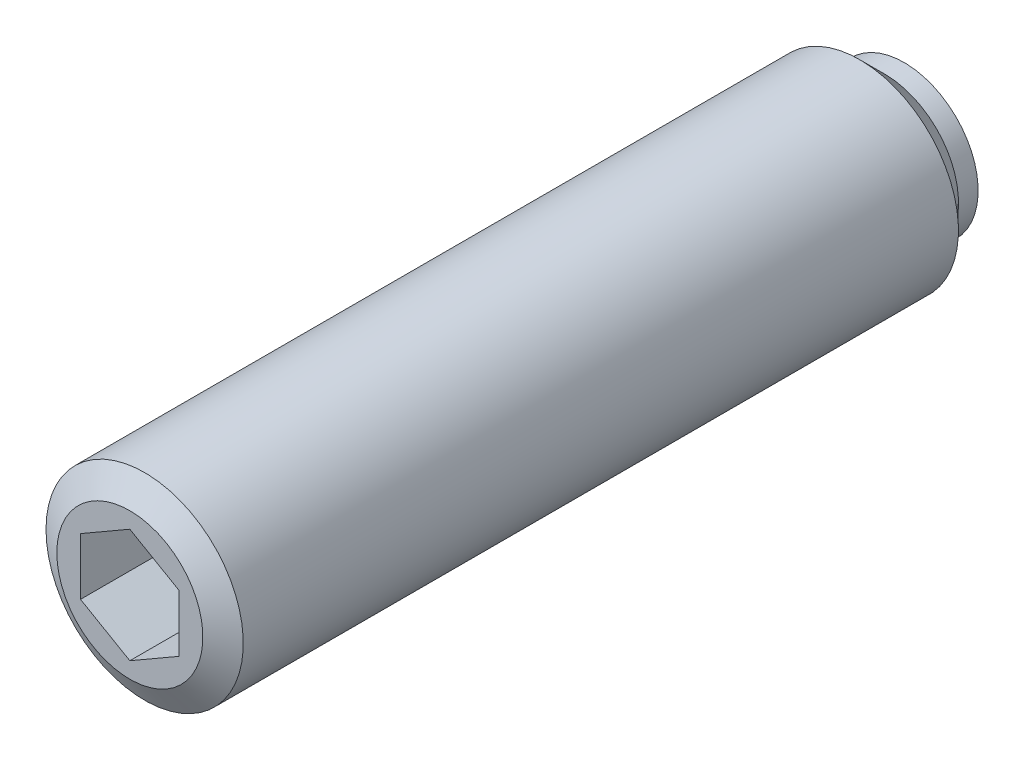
ISO-10303-21;
HEADER;
FILE_DESCRIPTION(('STEP AP214'),'2;1');
FILE_NAME('part.step','',(''),(''),'','','');
FILE_SCHEMA(('AUTOMOTIVE_DESIGN { 1 0 10303 214 1 1 1 1 }'));
ENDSEC;
DATA;
#1=APPLICATION_CONTEXT('core data for automotive mechanical design processes');
#2=APPLICATION_PROTOCOL_DEFINITION('international standard','automotive_design',2000,#1);
#3=PRODUCT_CONTEXT('',#1,'mechanical');
#4=PRODUCT('Part','Part','',(#3));
#5=PRODUCT_RELATED_PRODUCT_CATEGORY('part','',(#4));
#6=PRODUCT_DEFINITION_FORMATION('','',#4);
#7=PRODUCT_DEFINITION_CONTEXT('part definition',#1,'design');
#8=PRODUCT_DEFINITION('design','',#6,#7);
#9=PRODUCT_DEFINITION_SHAPE('','',#8);
#10=(LENGTH_UNIT() NAMED_UNIT(*) SI_UNIT(.MILLI.,.METRE.));
#11=(NAMED_UNIT(*) PLANE_ANGLE_UNIT() SI_UNIT($,.RADIAN.));
#12=(NAMED_UNIT(*) SI_UNIT($,.STERADIAN.) SOLID_ANGLE_UNIT());
#13=UNCERTAINTY_MEASURE_WITH_UNIT(LENGTH_MEASURE(1.E-05),#10,'distance_accuracy_value','');
#14=(GEOMETRIC_REPRESENTATION_CONTEXT(3) GLOBAL_UNCERTAINTY_ASSIGNED_CONTEXT((#13)) GLOBAL_UNIT_ASSIGNED_CONTEXT((#10,
#11,#12)) REPRESENTATION_CONTEXT('',''));
#15=CARTESIAN_POINT('',(0.,0.,0.));
#16=DIRECTION('',(0.,0.,1.));
#17=DIRECTION('',(1.,0.,0.));
#18=AXIS2_PLACEMENT_3D('',#15,#16,#17);
#19=CARTESIAN_POINT('',(0.,0.940733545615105,0.));
#20=DIRECTION('',(0.,0.,1.));
#21=DIRECTION('',(-1.,0.,0.));
#22=AXIS2_PLACEMENT_3D('',#19,#20,#21);
#23=PLANE('',#22);
#24=CARTESIAN_POINT('',(0.,0.,0.));
#25=DIRECTION('',(0.,0.,1.));
#26=DIRECTION('',(-1.,0.,0.));
#27=AXIS2_PLACEMENT_3D('',#24,#25,#26);
#28=CIRCLE('',#27,0.940733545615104);
#29=CARTESIAN_POINT('',(0.,0.940733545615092,0.));
#30=VERTEX_POINT('',#29);
#31=EDGE_CURVE('E9',#30,#30,#28,.T.);
#32=ORIENTED_EDGE('',*,*,#31,.F.);
#33=EDGE_LOOP('',(#32));
#34=FACE_BOUND('',#33,.T.);
#35=ADVANCED_FACE('F14',(#34),#23,.F.);
#36=CARTESIAN_POINT('',(0.,0.,0.823116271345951));
#37=DIRECTION('',(0.,0.,1.));
#38=DIRECTION('',(0.,1.,0.));
#39=AXIS2_PLACEMENT_3D('',#36,#37,#38);
#40=SPHERICAL_SURFACE('',#39,1.25);
#41=CARTESIAN_POINT('',(0.,0.,0.200000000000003));
#42=DIRECTION('',(0.,0.,1.));
#43=DIRECTION('',(-1.,0.,0.));
#44=AXIS2_PLACEMENT_3D('',#41,#42,#43);
#45=CIRCLE('',#44,1.08361714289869);
#46=CARTESIAN_POINT('',(0.,1.08361714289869,0.200000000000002));
#47=VERTEX_POINT('',#46);
#48=EDGE_CURVE('E21',#47,#47,#45,.T.);
#49=CARTESIAN_POINT('',(0.,1.08361714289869,0.200000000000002));
#50=CARTESIAN_POINT('',(0.,1.08233874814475,0.197776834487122));
#51=CARTESIAN_POINT('',(0.,1.08105351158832,0.195557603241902));
#52=CARTESIAN_POINT('',(0.,1.0784694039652,0.191127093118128));
#53=CARTESIAN_POINT('',(0.,1.0771705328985,0.188915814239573));
#54=CARTESIAN_POINT('',(0.,1.07455920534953,0.184501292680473));
#55=CARTESIAN_POINT('',(0.,1.07324674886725,0.182298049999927));
#56=CARTESIAN_POINT('',(0.,1.07060830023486,0.17789968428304));
#57=CARTESIAN_POINT('',(0.,1.06928230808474,0.175704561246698));
#58=CARTESIAN_POINT('',(0.,1.06661683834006,0.171322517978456));
#59=CARTESIAN_POINT('',(0.,1.0652773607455,0.169135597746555));
#60=CARTESIAN_POINT('',(0.,1.06258497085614,0.164770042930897));
#61=CARTESIAN_POINT('',(0.,1.06123205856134,0.16259140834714));
#62=CARTESIAN_POINT('',(0.,1.05851285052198,0.158242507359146));
#63=CARTESIAN_POINT('',(0.,1.05714655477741,0.156072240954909));
#64=CARTESIAN_POINT('',(0.,1.05440063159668,0.151740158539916));
#65=CARTESIAN_POINT('',(0.,1.05302100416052,0.14957834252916));
#66=CARTESIAN_POINT('',(0.,1.05024846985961,0.145263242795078));
#67=CARTESIAN_POINT('',(0.,1.04885556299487,0.143109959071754));
#68=CARTESIAN_POINT('',(0.,1.04605652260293,0.138812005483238));
#69=CARTESIAN_POINT('',(0.,1.04465038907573,0.136667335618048));
#70=CARTESIAN_POINT('',(0.,1.04182494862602,0.132386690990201));
#71=CARTESIAN_POINT('',(0.,1.04040564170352,0.130250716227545));
#72=CARTESIAN_POINT('',(0.,1.0375539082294,0.125987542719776));
#73=CARTESIAN_POINT('',(0.,1.03612148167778,0.123860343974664));
#74=CARTESIAN_POINT('',(0.,1.03324356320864,0.119614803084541));
#75=CARTESIAN_POINT('',(0.,1.03179807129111,0.117496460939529));
#76=CARTESIAN_POINT('',(0.,1.02889407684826,0.11326871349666));
#77=CARTESIAN_POINT('',(0.,1.02743557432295,0.111159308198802));
#78=CARTESIAN_POINT('',(0.,1.02450561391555,0.106949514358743));
#79=CARTESIAN_POINT('',(0.,1.02303415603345,0.104849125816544));
#80=CARTESIAN_POINT('',(0.,1.02007834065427,0.100657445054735));
#81=CARTESIAN_POINT('',(0.,1.01859398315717,0.0985661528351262));
#82=CARTESIAN_POINT('',(0.,1.01561242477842,0.094392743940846));
#83=CARTESIAN_POINT('',(0.,1.01411522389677,0.0923106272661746));
#84=CARTESIAN_POINT('',(0.,1.01110803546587,0.0881556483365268));
#85=CARTESIAN_POINT('',(0.,1.00959804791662,0.0860827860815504));
#86=CARTESIAN_POINT('',(0.,1.00656534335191,0.0819463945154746));
#87=CARTESIAN_POINT('',(0.,1.00504262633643,0.0798828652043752));
#88=CARTESIAN_POINT('',(0.,1.00198452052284,0.0757652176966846));
#89=CARTESIAN_POINT('',(0.,1.00044913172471,0.0737110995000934));
#90=CARTESIAN_POINT('',(0.,0.997365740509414,0.0696123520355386));
#91=CARTESIAN_POINT('',(0.,0.995817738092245,0.067567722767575));
#92=CARTESIAN_POINT('',(0.,0.992709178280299,0.063488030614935));
#93=CARTESIAN_POINT('',(0.,0.991148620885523,0.0614529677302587));
#94=CARTESIAN_POINT('',(0.,0.988015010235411,0.0573924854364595));
#95=CARTESIAN_POINT('',(0.,0.986441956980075,0.0553670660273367));
#96=CARTESIAN_POINT('',(0.,0.983283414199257,0.0513259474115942));
#97=CARTESIAN_POINT('',(0.,0.981697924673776,0.0493102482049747));
#98=CARTESIAN_POINT('',(0.,0.978514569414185,0.0452886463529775));
#99=CARTESIAN_POINT('',(0.,0.976916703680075,0.0432827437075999));
#100=CARTESIAN_POINT('',(0.,0.973708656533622,0.0392808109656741));
#101=CARTESIAN_POINT('',(0.,0.972098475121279,0.0372847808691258));
#102=CARTESIAN_POINT('',(0.,0.968865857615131,0.0333026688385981));
#103=CARTESIAN_POINT('',(0.,0.967243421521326,0.0313165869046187));
#104=CARTESIAN_POINT('',(0.,0.963986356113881,0.0273544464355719));
#105=CARTESIAN_POINT('',(0.,0.962351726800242,0.0253783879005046));
#106=CARTESIAN_POINT('',(0.,0.959070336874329,0.0214363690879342));
#107=CARTESIAN_POINT('',(0.,0.957423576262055,0.0194704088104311));
#108=CARTESIAN_POINT('',(0.,0.954117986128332,0.0155486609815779));
#109=CARTESIAN_POINT('',(0.,0.952459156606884,0.0135928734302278));
#110=CARTESIAN_POINT('',(0.,0.949129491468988,0.00969154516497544));
#111=CARTESIAN_POINT('',(0.,0.947458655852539,0.00774600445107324));
#112=CARTESIAN_POINT('',(0.,0.944105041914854,0.00386524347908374));
#113=CARTESIAN_POINT('',(0.,0.942422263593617,0.00193002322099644));
#114=CARTESIAN_POINT('',(0.,0.940733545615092,0.));
#115=B_SPLINE_CURVE_WITH_KNOTS('',3,(#49,#50,#51,#52,#53,#54,#55,#56,#57,#58,#59,#60,#61,#62,
#63,#64,#65,#66,#67,#68,#69,#70,#71,#72,#73,#74,#75,#76,#77,#78,#79,#80,#81,#82,#83,#84,#85,#86,
#87,#88,#89,#90,#91,#92,#93,#94,#95,#96,#97,#98,#99,#100,#101,#102,#103,#104,#105,#106,#107,
#108,#109,#110,#111,#112,#113,#114),.UNSPECIFIED.,.F.,.F.,(4,2,2,2,2,2,2,2,2,2,2,2,2,2,2,2,2,2,
2,2,2,2,2,2,2,2,2,2,2,2,2,2,4),(0.,0.00769354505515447,0.0153870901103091,0.0230806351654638,
0.0307741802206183,0.0384677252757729,0.0461612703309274,0.0538548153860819,0.0615483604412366,
0.0692419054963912,0.0769354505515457,0.0846289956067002,0.0923225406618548,0.100016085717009,
0.107709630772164,0.115403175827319,0.123096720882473,0.130790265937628,0.138483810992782,
0.146177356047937,0.153870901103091,0.161564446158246,0.169257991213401,0.176951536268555,
0.18464508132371,0.192338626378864,0.200032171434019,0.207725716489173,0.215419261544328,
0.223112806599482,0.230806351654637,0.238499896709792,0.246193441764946),.UNSPECIFIED.);
#116=EDGE_CURVE('BSEAM141',#47,#30,#115,.T.);
#117=ORIENTED_EDGE('',*,*,#48,.F.);
#118=ORIENTED_EDGE('',*,*,#31,.T.);
#119=ORIENTED_EDGE('',*,*,#116,.T.);
#120=ORIENTED_EDGE('',*,*,#116,.F.);
#121=EDGE_LOOP('',(#117,#119,#118,#120));
#122=FACE_BOUND('',#121,.T.);
#123=ADVANCED_FACE('F141',(#122),#40,.T.);
#124=CARTESIAN_POINT('',(0.,1.5,0.200000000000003));
#125=DIRECTION('',(0.,0.,1.));
#126=DIRECTION('',(-1.,0.,0.));
#127=AXIS2_PLACEMENT_3D('',#124,#125,#126);
#128=PLANE('',#127);
#129=CARTESIAN_POINT('',(0.,0.,0.200000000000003));
#130=DIRECTION('',(0.,0.,1.));
#131=DIRECTION('',(-1.,0.,0.));
#132=AXIS2_PLACEMENT_3D('',#129,#130,#131);
#133=CIRCLE('',#132,1.5);
#134=CARTESIAN_POINT('',(-1.5,0.,0.200000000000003));
#135=VERTEX_POINT('',#134);
#136=EDGE_CURVE('E134',#135,#135,#133,.T.);
#137=ORIENTED_EDGE('',*,*,#136,.F.);
#138=EDGE_LOOP('',(#137));
#139=FACE_BOUND('',#138,.T.);
#140=ORIENTED_EDGE('',*,*,#48,.T.);
#141=EDGE_LOOP('',(#140));
#142=FACE_BOUND('',#141,.T.);
#143=ADVANCED_FACE('F139',(#139,#142),#128,.F.);
#144=CARTESIAN_POINT('',(0.,0.,17.2950749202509));
#145=DIRECTION('',(0.,0.,1.));
#146=DIRECTION('',(-1.,0.,0.));
#147=AXIS2_PLACEMENT_3D('',#144,#145,#146);
#148=CYLINDRICAL_SURFACE('',#147,1.5);
#149=CARTESIAN_POINT('',(0.,0.,0.6));
#150=DIRECTION('',(0.,0.,1.));
#151=DIRECTION('',(-1.,0.,0.));
#152=AXIS2_PLACEMENT_3D('',#149,#150,#151);
#153=CIRCLE('',#152,1.5);
#154=CARTESIAN_POINT('',(-1.5,0.,0.6));
#155=VERTEX_POINT('',#154);
#156=EDGE_CURVE('E131',#155,#155,#153,.T.);
#157=ORIENTED_EDGE('',*,*,#156,.F.);
#158=EDGE_LOOP('',(#157));
#159=FACE_BOUND('',#158,.T.);
#160=ORIENTED_EDGE('',*,*,#136,.T.);
#161=EDGE_LOOP('',(#160));
#162=FACE_BOUND('',#161,.T.);
#163=ADVANCED_FACE('F164',(#159,#162),#148,.T.);
#164=CARTESIAN_POINT('',(0.,0.,0.6));
#165=DIRECTION('',(0.,0.,1.));
#166=DIRECTION('',(-1.,0.,0.));
#167=AXIS2_PLACEMENT_3D('',#164,#165,#166);
#168=CONICAL_SURFACE('',#167,1.5,0.78539816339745);
#169=CARTESIAN_POINT('',(0.,0.,1.1));
#170=DIRECTION('',(0.,0.,1.));
#171=DIRECTION('',(-1.,0.,0.));
#172=AXIS2_PLACEMENT_3D('',#169,#170,#171);
#173=CIRCLE('',#172,2.);
#174=CARTESIAN_POINT('',(-2.,0.,1.1));
#175=VERTEX_POINT('',#174);
#176=EDGE_CURVE('E128',#175,#175,#173,.T.);
#177=ORIENTED_EDGE('',*,*,#176,.F.);
#178=EDGE_LOOP('',(#177));
#179=FACE_BOUND('',#178,.T.);
#180=ORIENTED_EDGE('',*,*,#156,.T.);
#181=EDGE_LOOP('',(#180));
#182=FACE_BOUND('',#181,.T.);
#183=ADVANCED_FACE('F173',(#179,#182),#168,.T.);
#184=CARTESIAN_POINT('',(0.,0.,17.2950749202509));
#185=DIRECTION('',(0.,0.,1.));
#186=DIRECTION('',(-1.,0.,0.));
#187=AXIS2_PLACEMENT_3D('',#184,#185,#186);
#188=CYLINDRICAL_SURFACE('',#187,2.);
#189=CARTESIAN_POINT('',(0.,0.,15.6));
#190=DIRECTION('',(0.,0.,1.));
#191=DIRECTION('',(-1.,0.,0.));
#192=AXIS2_PLACEMENT_3D('',#189,#190,#191);
#193=CIRCLE('',#192,2.);
#194=CARTESIAN_POINT('',(-2.,0.,15.6));
#195=VERTEX_POINT('',#194);
#196=EDGE_CURVE('E125',#195,#195,#193,.T.);
#197=ORIENTED_EDGE('',*,*,#196,.F.);
#198=EDGE_LOOP('',(#197));
#199=FACE_BOUND('',#198,.T.);
#200=ORIENTED_EDGE('',*,*,#176,.T.);
#201=EDGE_LOOP('',(#200));
#202=FACE_BOUND('',#201,.T.);
#203=ADVANCED_FACE('F182',(#199,#202),#188,.T.);
#204=CARTESIAN_POINT('',(0.,0.,15.6));
#205=DIRECTION('',(0.,0.,-1.));
#206=DIRECTION('',(1.,0.,0.));
#207=AXIS2_PLACEMENT_3D('',#204,#205,#206);
#208=CONICAL_SURFACE('',#207,2.,1.04719755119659);
#209=CARTESIAN_POINT('',(0.,0.,15.9));
#210=DIRECTION('',(0.,0.,1.));
#211=DIRECTION('',(-1.,0.,0.));
#212=AXIS2_PLACEMENT_3D('',#209,#210,#211);
#213=CIRCLE('',#212,1.48038475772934);
#214=CARTESIAN_POINT('',(-1.48038475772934,0.,15.9));
#215=VERTEX_POINT('',#214);
#216=EDGE_CURVE('E116',#215,#215,#213,.T.);
#217=ORIENTED_EDGE('',*,*,#216,.F.);
#218=EDGE_LOOP('',(#217));
#219=FACE_BOUND('',#218,.T.);
#220=ORIENTED_EDGE('',*,*,#196,.T.);
#221=EDGE_LOOP('',(#220));
#222=FACE_BOUND('',#221,.T.);
#223=ADVANCED_FACE('F191',(#219,#222),#208,.T.);
#224=CARTESIAN_POINT('',(0.,0.,15.9));
#225=DIRECTION('',(0.,0.,-1.));
#226=DIRECTION('',(1.,0.,0.));
#227=AXIS2_PLACEMENT_3D('',#224,#225,#226);
#228=PLANE('',#227);
#229=DIRECTION('',(-0.866025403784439,-0.5,0.));
#230=VECTOR('',#229,1.);
#231=CARTESIAN_POINT('',(0.,1.15470053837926,15.9));
#232=LINE('',#231,#230);
#233=CARTESIAN_POINT('',(0.,1.15470053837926,15.9));
#234=VERTEX_POINT('',#233);
#235=CARTESIAN_POINT('',(-1.,0.577350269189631,15.9));
#236=VERTEX_POINT('',#235);
#237=EDGE_CURVE('E82',#234,#236,#232,.T.);
#238=ORIENTED_EDGE('',*,*,#237,.F.);
#239=DIRECTION('',(-0.866025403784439,0.5,0.));
#240=VECTOR('',#239,1.);
#241=CARTESIAN_POINT('',(1.,0.577350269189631,15.9));
#242=LINE('',#241,#240);
#243=CARTESIAN_POINT('',(1.,0.577350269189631,15.9));
#244=VERTEX_POINT('',#243);
#245=EDGE_CURVE('E28',#244,#234,#242,.T.);
#246=ORIENTED_EDGE('',*,*,#245,.F.);
#247=DIRECTION('',(0.,1.,0.));
#248=VECTOR('',#247,1.);
#249=CARTESIAN_POINT('',(1.,-0.577350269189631,15.9));
#250=LINE('',#249,#248);
#251=CARTESIAN_POINT('',(1.,-0.577350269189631,15.9));
#252=VERTEX_POINT('',#251);
#253=EDGE_CURVE('E98',#252,#244,#250,.T.);
#254=ORIENTED_EDGE('',*,*,#253,.F.);
#255=DIRECTION('',(0.866025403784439,0.5,0.));
#256=VECTOR('',#255,1.);
#257=CARTESIAN_POINT('',(0.,-1.15470053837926,15.9));
#258=LINE('',#257,#256);
#259=CARTESIAN_POINT('',(0.,-1.15470053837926,15.9));
#260=VERTEX_POINT('',#259);
#261=EDGE_CURVE('E92',#260,#252,#258,.T.);
#262=ORIENTED_EDGE('',*,*,#261,.F.);
#263=DIRECTION('',(0.866025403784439,-0.5,0.));
#264=VECTOR('',#263,1.);
#265=CARTESIAN_POINT('',(-1.,-0.577350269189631,15.9));
#266=LINE('',#265,#264);
#267=CARTESIAN_POINT('',(-1.,-0.577350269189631,15.9));
#268=VERTEX_POINT('',#267);
#269=EDGE_CURVE('E90',#268,#260,#266,.T.);
#270=ORIENTED_EDGE('',*,*,#269,.F.);
#271=DIRECTION('',(0.,-1.,0.));
#272=VECTOR('',#271,1.);
#273=CARTESIAN_POINT('',(-1.,0.577350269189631,15.9));
#274=LINE('',#273,#272);
#275=EDGE_CURVE('E71',#236,#268,#274,.T.);
#276=ORIENTED_EDGE('',*,*,#275,.F.);
#277=EDGE_LOOP('',(#238,#246,#254,#262,#270,#276));
#278=FACE_BOUND('',#277,.T.);
#279=ORIENTED_EDGE('',*,*,#216,.T.);
#280=EDGE_LOOP('',(#279));
#281=FACE_BOUND('',#280,.T.);
#282=ADVANCED_FACE('F86',(#278,#281),#228,.F.);
#283=CARTESIAN_POINT('',(1.,0.577350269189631,13.9));
#284=DIRECTION('',(0.5,0.866025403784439,0.));
#285=DIRECTION('',(0.866025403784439,-0.5,0.));
#286=AXIS2_PLACEMENT_3D('',#283,#284,#285);
#287=PLANE('',#286);
#288=ORIENTED_EDGE('',*,*,#245,.T.);
#289=DIRECTION('',(0.,0.,1.));
#290=VECTOR('',#289,1.);
#291=CARTESIAN_POINT('',(0.,1.15470053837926,13.9));
#292=LINE('',#291,#290);
#293=CARTESIAN_POINT('',(0.,1.15470053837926,13.9));
#294=VERTEX_POINT('',#293);
#295=EDGE_CURVE('E79',#294,#234,#292,.T.);
#296=ORIENTED_EDGE('',*,*,#295,.F.);
#297=DIRECTION('',(-0.866025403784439,0.5,0.));
#298=VECTOR('',#297,1.);
#299=CARTESIAN_POINT('',(1.,0.577350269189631,13.9));
#300=LINE('',#299,#298);
#301=CARTESIAN_POINT('',(1.,0.577350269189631,13.9));
#302=VERTEX_POINT('',#301);
#303=EDGE_CURVE('E100',#302,#294,#300,.T.);
#304=ORIENTED_EDGE('',*,*,#303,.F.);
#305=DIRECTION('',(0.,0.,1.));
#306=VECTOR('',#305,1.);
#307=CARTESIAN_POINT('',(1.,0.577350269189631,13.9));
#308=LINE('',#307,#306);
#309=EDGE_CURVE('E35',#302,#244,#308,.T.);
#310=ORIENTED_EDGE('',*,*,#309,.T.);
#311=EDGE_LOOP('',(#288,#296,#304,#310));
#312=FACE_BOUND('',#311,.T.);
#313=ADVANCED_FACE('F208',(#312),#287,.F.);
#314=CARTESIAN_POINT('',(1.,-0.577350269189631,13.9));
#315=DIRECTION('',(1.,0.,0.));
#316=DIRECTION('',(0.,-1.,0.));
#317=AXIS2_PLACEMENT_3D('',#314,#315,#316);
#318=PLANE('',#317);
#319=ORIENTED_EDGE('',*,*,#253,.T.);
#320=ORIENTED_EDGE('',*,*,#309,.F.);
#321=DIRECTION('',(0.,1.,0.));
#322=VECTOR('',#321,1.);
#323=CARTESIAN_POINT('',(1.,-0.577350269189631,13.9));
#324=LINE('',#323,#322);
#325=CARTESIAN_POINT('',(1.,-0.577350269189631,13.9));
#326=VERTEX_POINT('',#325);
#327=EDGE_CURVE('E112',#326,#302,#324,.T.);
#328=ORIENTED_EDGE('',*,*,#327,.F.);
#329=DIRECTION('',(0.,0.,1.));
#330=VECTOR('',#329,1.);
#331=CARTESIAN_POINT('',(1.,-0.577350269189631,13.9));
#332=LINE('',#331,#330);
#333=EDGE_CURVE('E117',#326,#252,#332,.T.);
#334=ORIENTED_EDGE('',*,*,#333,.T.);
#335=EDGE_LOOP('',(#319,#320,#328,#334));
#336=FACE_BOUND('',#335,.T.);
#337=ADVANCED_FACE('F216',(#336),#318,.F.);
#338=CARTESIAN_POINT('',(0.,-1.15470053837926,13.9));
#339=DIRECTION('',(0.5,-0.866025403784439,0.));
#340=DIRECTION('',(-0.866025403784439,-0.5,0.));
#341=AXIS2_PLACEMENT_3D('',#338,#339,#340);
#342=PLANE('',#341);
#343=ORIENTED_EDGE('',*,*,#261,.T.);
#344=ORIENTED_EDGE('',*,*,#333,.F.);
#345=DIRECTION('',(0.866025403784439,0.5,0.));
#346=VECTOR('',#345,1.);
#347=CARTESIAN_POINT('',(0.,-1.15470053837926,13.9));
#348=LINE('',#347,#346);
#349=CARTESIAN_POINT('',(0.,-1.15470053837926,13.9));
#350=VERTEX_POINT('',#349);
#351=EDGE_CURVE('E109',#350,#326,#348,.T.);
#352=ORIENTED_EDGE('',*,*,#351,.F.);
#353=DIRECTION('',(0.,0.,1.));
#354=VECTOR('',#353,1.);
#355=CARTESIAN_POINT('',(0.,-1.15470053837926,13.9));
#356=LINE('',#355,#354);
#357=EDGE_CURVE('E119',#350,#260,#356,.T.);
#358=ORIENTED_EDGE('',*,*,#357,.T.);
#359=EDGE_LOOP('',(#343,#344,#352,#358));
#360=FACE_BOUND('',#359,.T.);
#361=ADVANCED_FACE('F224',(#360),#342,.F.);
#362=CARTESIAN_POINT('',(-1.,-0.577350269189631,13.9));
#363=DIRECTION('',(-0.5,-0.866025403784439,0.));
#364=DIRECTION('',(-0.866025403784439,0.5,0.));
#365=AXIS2_PLACEMENT_3D('',#362,#363,#364);
#366=PLANE('',#365);
#367=ORIENTED_EDGE('',*,*,#269,.T.);
#368=ORIENTED_EDGE('',*,*,#357,.F.);
#369=DIRECTION('',(0.866025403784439,-0.5,0.));
#370=VECTOR('',#369,1.);
#371=CARTESIAN_POINT('',(-1.,-0.577350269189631,13.9));
#372=LINE('',#371,#370);
#373=CARTESIAN_POINT('',(-1.,-0.577350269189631,13.9));
#374=VERTEX_POINT('',#373);
#375=EDGE_CURVE('E106',#374,#350,#372,.T.);
#376=ORIENTED_EDGE('',*,*,#375,.F.);
#377=DIRECTION('',(0.,0.,1.));
#378=VECTOR('',#377,1.);
#379=CARTESIAN_POINT('',(-1.,-0.577350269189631,13.9));
#380=LINE('',#379,#378);
#381=EDGE_CURVE('E78',#374,#268,#380,.T.);
#382=ORIENTED_EDGE('',*,*,#381,.T.);
#383=EDGE_LOOP('',(#367,#368,#376,#382));
#384=FACE_BOUND('',#383,.T.);
#385=ADVANCED_FACE('F232',(#384),#366,.F.);
#386=CARTESIAN_POINT('',(-1.,0.577350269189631,13.9));
#387=DIRECTION('',(-1.,0.,0.));
#388=DIRECTION('',(0.,0.,-1.));
#389=AXIS2_PLACEMENT_3D('',#386,#387,#388);
#390=PLANE('',#389);
#391=ORIENTED_EDGE('',*,*,#275,.T.);
#392=ORIENTED_EDGE('',*,*,#381,.F.);
#393=DIRECTION('',(0.,-1.,0.));
#394=VECTOR('',#393,1.);
#395=CARTESIAN_POINT('',(-1.,0.577350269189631,13.9));
#396=LINE('',#395,#394);
#397=CARTESIAN_POINT('',(-1.,0.577350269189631,13.9));
#398=VERTEX_POINT('',#397);
#399=EDGE_CURVE('E74',#398,#374,#396,.T.);
#400=ORIENTED_EDGE('',*,*,#399,.F.);
#401=DIRECTION('',(0.,0.,1.));
#402=VECTOR('',#401,1.);
#403=CARTESIAN_POINT('',(-1.,0.577350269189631,13.9));
#404=LINE('',#403,#402);
#405=EDGE_CURVE('E67',#398,#236,#404,.T.);
#406=ORIENTED_EDGE('',*,*,#405,.T.);
#407=EDGE_LOOP('',(#391,#392,#400,#406));
#408=FACE_BOUND('',#407,.T.);
#409=ADVANCED_FACE('F69',(#408),#390,.F.);
#410=CARTESIAN_POINT('',(0.,1.15470053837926,13.9));
#411=DIRECTION('',(-0.5,0.866025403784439,0.));
#412=DIRECTION('',(0.866025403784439,0.5,0.));
#413=AXIS2_PLACEMENT_3D('',#410,#411,#412);
#414=PLANE('',#413);
#415=ORIENTED_EDGE('',*,*,#237,.T.);
#416=ORIENTED_EDGE('',*,*,#405,.F.);
#417=DIRECTION('',(-0.866025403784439,-0.5,0.));
#418=VECTOR('',#417,1.);
#419=CARTESIAN_POINT('',(0.,1.15470053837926,13.9));
#420=LINE('',#419,#418);
#421=EDGE_CURVE('E103',#294,#398,#420,.T.);
#422=ORIENTED_EDGE('',*,*,#421,.F.);
#423=ORIENTED_EDGE('',*,*,#295,.T.);
#424=EDGE_LOOP('',(#415,#416,#422,#423));
#425=FACE_BOUND('',#424,.T.);
#426=ADVANCED_FACE('F83',(#425),#414,.F.);
#427=CARTESIAN_POINT('',(2.,0.,13.9));
#428=DIRECTION('',(0.,0.,-1.));
#429=DIRECTION('',(1.,0.,0.));
#430=AXIS2_PLACEMENT_3D('',#427,#428,#429);
#431=PLANE('',#430);
#432=ORIENTED_EDGE('',*,*,#303,.T.);
#433=ORIENTED_EDGE('',*,*,#421,.T.);
#434=ORIENTED_EDGE('',*,*,#399,.T.);
#435=ORIENTED_EDGE('',*,*,#375,.T.);
#436=ORIENTED_EDGE('',*,*,#351,.T.);
#437=ORIENTED_EDGE('',*,*,#327,.T.);
#438=EDGE_LOOP('',(#432,#433,#434,#435,#436,#437));
#439=FACE_BOUND('',#438,.T.);
#440=ADVANCED_FACE('F256',(#439),#431,.F.);
#441=CLOSED_SHELL('',(#35,#123,#143,#163,#183,#203,#223,#282,#313,#337,#361,#385,#409,#426,#440));
#442=MANIFOLD_SOLID_BREP('B1',#441);
#443=ADVANCED_BREP_SHAPE_REPRESENTATION('',(#18,#442),#14);
#444=SHAPE_DEFINITION_REPRESENTATION(#9,#443);
ENDSEC;
END-ISO-10303-21;
